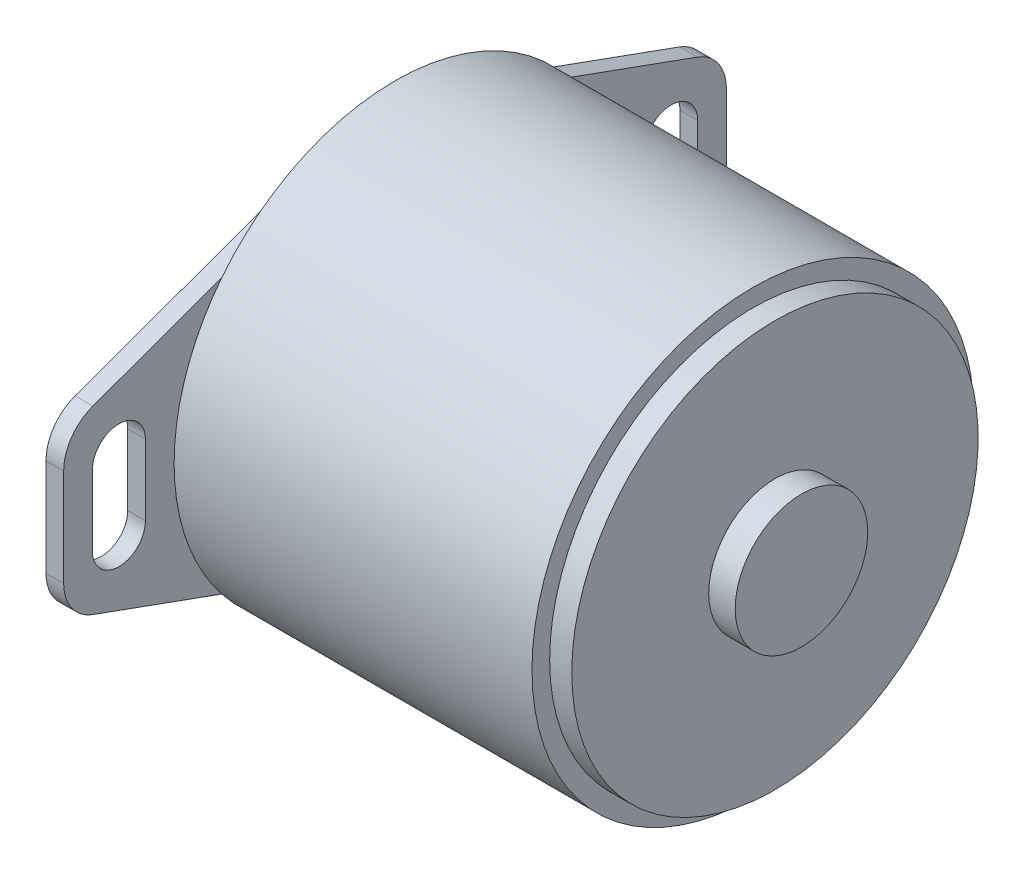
from build123d import *

# Parameters (mm, degrees)
SKETCH2_R           = 4.128830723
BOSS_EXTRUDE1_DEPTH = 0.8


with BuildPart() as part:
    # Sketch1 → Revolve1 (revolve)
    with BuildSketch(Plane.XY, mode=Mode.PRIVATE) as revolve1_sk:
        Polygon((0, 0), (0, 0.75), (4.2, 0.75), (4.2, 3), (6.2, 3), (6.2, 10), (22.4, 10), (22.4, 9.2), (23.4, 9.2), (23.4, 3), (24.6, 3), (24.6, 0), align=None)
    revolve(revolve1_sk.sketch.rotate(Axis((-32.441525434, 0, 0), (1, 0, 0)), 90), axis=Axis((-32.441525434, 0, 0), (1, 0, 0)))

    # Sketch2 → Boss-Extrude1 (add)
    with BuildSketch(Plane.ZY.offset(-6.2)):
        with BuildLine():
            Line((-2.892803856, 7.992601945), (-13.680659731, 4.088097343))
            ThreePointArc((-13.680659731, 4.088097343), (-14.637272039, 3.356110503), (-15, 2.207485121))
            Line((-15, 2.207485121), (-15, -2.207485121))
            ThreePointArc((-15, -2.207485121), (-14.637272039, -3.356110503), (-13.680659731, -4.088097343))
            Line((-13.680659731, -4.088097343), (-2.892803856, -7.992601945))
            ThreePointArc((-2.892803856, -7.992601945), (0, -8.5), (2.892803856, -7.992601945))
            Line((2.892803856, -7.992601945), (13.680659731, -4.088097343))
            ThreePointArc((13.680659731, -4.088097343), (14.637272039, -3.356110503), (15, -2.207485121))
            Line((15, -2.207485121), (15, 2.207485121))
            ThreePointArc((15, 2.207485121), (14.637272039, 3.356110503), (13.680659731, 4.088097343))
            Line((13.680659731, 4.088097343), (2.892803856, 7.992601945))
            ThreePointArc((2.892803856, 7.992601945), (0, 8.5), (-2.892803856, 7.992601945))
        make_face()
        Circle(SKETCH2_R, mode=Mode.SUBTRACT)
        with BuildLine():
            Line((-11.3, 1.6), (-11.3, -1.6))
            ThreePointArc((-11.3, -1.6), (-12.5, -2.8), (-13.7, -1.6))
            Line((-13.7, -1.6), (-13.7, 1.6))
            ThreePointArc((-13.7, 1.6), (-12.5, 2.8), (-11.3, 1.6))
        make_face(mode=Mode.SUBTRACT)
        with BuildLine():
            Line((11.3, 1.6), (11.3, -1.6))
            ThreePointArc((11.3, -1.6), (12.5, -2.8), (13.7, -1.6))
            Line((13.7, -1.6), (13.7, 1.6))
            ThreePointArc((13.7, 1.6), (12.5, 2.8), (11.3, 1.6))
        make_face(mode=Mode.SUBTRACT)
    extrude(amount=BOSS_EXTRUDE1_DEPTH)


solid = part.part
